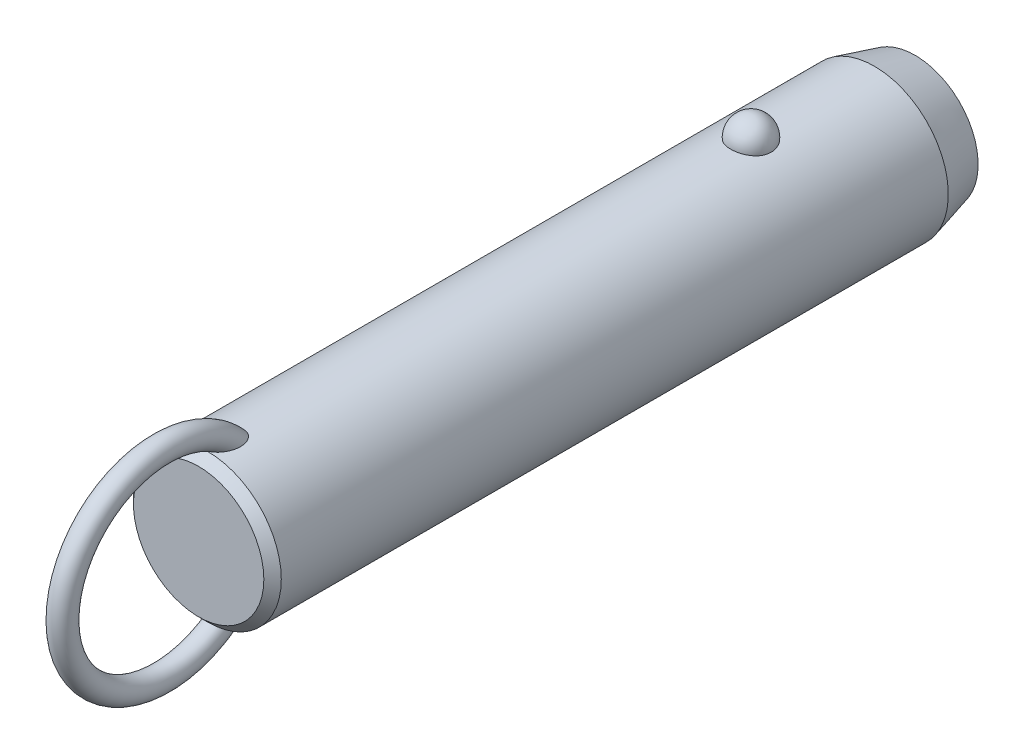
ISO-10303-21;
HEADER;
FILE_DESCRIPTION(('STEP AP214'),'2;1');
FILE_NAME('part.step','',(''),(''),'','','');
FILE_SCHEMA(('AUTOMOTIVE_DESIGN { 1 0 10303 214 1 1 1 1 }'));
ENDSEC;
DATA;
#1=APPLICATION_CONTEXT('core data for automotive mechanical design processes');
#2=APPLICATION_PROTOCOL_DEFINITION('international standard','automotive_design',2000,#1);
#3=PRODUCT_CONTEXT('',#1,'mechanical');
#4=PRODUCT('Part','Part','',(#3));
#5=PRODUCT_RELATED_PRODUCT_CATEGORY('part','',(#4));
#6=PRODUCT_DEFINITION_FORMATION('','',#4);
#7=PRODUCT_DEFINITION_CONTEXT('part definition',#1,'design');
#8=PRODUCT_DEFINITION('design','',#6,#7);
#9=PRODUCT_DEFINITION_SHAPE('','',#8);
#10=(LENGTH_UNIT() NAMED_UNIT(*) SI_UNIT(.MILLI.,.METRE.));
#11=(NAMED_UNIT(*) PLANE_ANGLE_UNIT() SI_UNIT($,.RADIAN.));
#12=(NAMED_UNIT(*) SI_UNIT($,.STERADIAN.) SOLID_ANGLE_UNIT());
#13=UNCERTAINTY_MEASURE_WITH_UNIT(LENGTH_MEASURE(1.E-05),#10,'distance_accuracy_value','');
#14=(GEOMETRIC_REPRESENTATION_CONTEXT(3) GLOBAL_UNCERTAINTY_ASSIGNED_CONTEXT((#13)) GLOBAL_UNIT_ASSIGNED_CONTEXT((#10,
#11,#12)) REPRESENTATION_CONTEXT('',''));
#15=CARTESIAN_POINT('',(0.,0.,0.));
#16=DIRECTION('',(0.,0.,1.));
#17=DIRECTION('',(1.,0.,0.));
#18=AXIS2_PLACEMENT_3D('',#15,#16,#17);
#19=CARTESIAN_POINT('',(0.,0.,78.7));
#20=DIRECTION('',(0.,0.,-1.));
#21=DIRECTION('',(-1.,0.,0.));
#22=AXIS2_PLACEMENT_3D('',#19,#20,#21);
#23=CYLINDRICAL_SURFACE('',#22,12.7);
#24=CARTESIAN_POINT('',(3.46661256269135,12.2177165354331,-3.5));
#25=CARTESIAN_POINT('',(3.4666090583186,12.2177194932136,-3.30432790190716));
#26=CARTESIAN_POINT('',(3.45063567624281,12.2222841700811,-3.10861112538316));
#27=CARTESIAN_POINT('',(3.38712451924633,12.2400345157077,-2.72271899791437));
#28=CARTESIAN_POINT('',(3.33957415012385,12.2532236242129,-2.53254588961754));
#29=CARTESIAN_POINT('',(3.2141234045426,12.286724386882,-2.16324948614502));
#30=CARTESIAN_POINT('',(3.13623639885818,12.3070329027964,-1.98412136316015));
#31=CARTESIAN_POINT('',(2.95205930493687,12.3525018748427,-1.64180592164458));
#32=CARTESIAN_POINT('',(2.84577003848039,12.3776621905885,-1.47861814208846));
#33=CARTESIAN_POINT('',(2.60688050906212,12.4301712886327,-1.17190583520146));
#34=CARTESIAN_POINT('',(2.47415697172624,12.4575299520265,-1.02847897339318));
#35=CARTESIAN_POINT('',(2.18615174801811,12.5112810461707,-0.766177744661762));
#36=CARTESIAN_POINT('',(2.03087002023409,12.5376734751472,-0.64730342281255));
#37=CARTESIAN_POINT('',(1.70237334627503,12.5864761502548,-0.437732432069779));
#38=CARTESIAN_POINT('',(1.52920948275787,12.6088972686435,-0.346958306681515));
#39=CARTESIAN_POINT('',(1.16944170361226,12.6473352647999,-0.195750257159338));
#40=CARTESIAN_POINT('',(0.982839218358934,12.663352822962,-0.135313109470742));
#41=CARTESIAN_POINT('',(0.604961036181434,12.6869706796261,-0.0473241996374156));
#42=CARTESIAN_POINT('',(0.41382314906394,12.6947125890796,-0.0192185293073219));
#43=CARTESIAN_POINT('',(0.0293827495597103,12.7014203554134,0.0051725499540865));
#44=CARTESIAN_POINT('',(-0.163919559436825,12.7003870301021,0.00146092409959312));
#45=CARTESIAN_POINT('',(-0.544374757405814,12.689735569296,-0.0373939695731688));
#46=CARTESIAN_POINT('',(-0.731575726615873,12.6802364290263,-0.0721015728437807));
#47=CARTESIAN_POINT('',(-1.09733277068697,12.6538333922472,-0.171364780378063));
#48=CARTESIAN_POINT('',(-1.27588869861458,12.6369293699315,-0.235920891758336));
#49=CARTESIAN_POINT('',(-1.6204698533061,12.5973946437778,-0.393548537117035));
#50=CARTESIAN_POINT('',(-1.78641865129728,12.5747321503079,-0.486778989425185));
#51=CARTESIAN_POINT('',(-2.10030671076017,12.5261316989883,-0.699110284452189));
#52=CARTESIAN_POINT('',(-2.24824419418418,12.5001934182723,-0.818213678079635));
#53=CARTESIAN_POINT('',(-2.52491489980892,12.4472906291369,-1.08157124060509));
#54=CARTESIAN_POINT('',(-2.65324222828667,12.4203160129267,-1.22624992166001));
#55=CARTESIAN_POINT('',(-2.88410007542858,12.3687509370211,-1.53528325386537));
#56=CARTESIAN_POINT('',(-2.98662883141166,12.3441606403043,-1.69963924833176));
#57=CARTESIAN_POINT('',(-3.16432417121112,12.2998199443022,-2.04548497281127));
#58=CARTESIAN_POINT('',(-3.23917525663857,12.2801261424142,-2.22714424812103));
#59=CARTESIAN_POINT('',(-3.35800573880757,12.248167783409,-2.6009138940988));
#60=CARTESIAN_POINT('',(-3.4019860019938,12.2359030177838,-2.79302397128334));
#61=CARTESIAN_POINT('',(-3.45784812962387,12.2202347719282,-3.18140279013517));
#62=CARTESIAN_POINT('',(-3.46986123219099,12.2167950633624,-3.37765118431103));
#63=CARTESIAN_POINT('',(-3.46186273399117,12.2190638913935,-3.76943689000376));
#64=CARTESIAN_POINT('',(-3.44185196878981,12.2247721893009,-3.96497421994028));
#65=CARTESIAN_POINT('',(-3.37048652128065,12.2446381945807,-4.34881728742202));
#66=CARTESIAN_POINT('',(-3.31928253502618,12.2587552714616,-4.53715319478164));
#67=CARTESIAN_POINT('',(-3.18693461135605,12.2938237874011,-4.90231727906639));
#68=CARTESIAN_POINT('',(-3.1057895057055,12.3147754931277,-5.07914500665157));
#69=CARTESIAN_POINT('',(-2.91506431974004,12.3613125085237,-5.41732059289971));
#70=CARTESIAN_POINT('',(-2.80533587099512,12.3869217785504,-5.57858147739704));
#71=CARTESIAN_POINT('',(-2.560414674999,12.4398525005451,-5.88013283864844));
#72=CARTESIAN_POINT('',(-2.42522099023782,12.4671740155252,-6.02042254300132));
#73=CARTESIAN_POINT('',(-2.1323357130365,12.5205965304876,-6.27662798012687));
#74=CARTESIAN_POINT('',(-1.97456596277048,12.5466928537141,-6.3924554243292));
#75=CARTESIAN_POINT('',(-1.64115839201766,12.5946384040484,-6.59583547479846));
#76=CARTESIAN_POINT('',(-1.46552179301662,12.6164879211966,-6.68339001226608));
#77=CARTESIAN_POINT('',(-1.10356050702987,12.6532533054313,-6.82682153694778));
#78=CARTESIAN_POINT('',(-0.9173913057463,12.6682500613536,-6.8830698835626));
#79=CARTESIAN_POINT('',(-0.537836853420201,12.6900288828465,-6.96386887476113));
#80=CARTESIAN_POINT('',(-0.344452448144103,12.6968119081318,-6.9884232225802));
#81=CARTESIAN_POINT('',(0.0402577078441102,12.7013667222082,-7.00496469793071));
#82=CARTESIAN_POINT('',(0.231556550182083,12.6993008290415,-6.99753844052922));
#83=CARTESIAN_POINT('',(0.610105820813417,12.6867505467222,-6.9516636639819));
#84=CARTESIAN_POINT('',(0.797356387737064,12.6762664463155,-6.913216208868));
#85=CARTESIAN_POINT('',(1.16186657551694,12.6480587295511,-6.80658431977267));
#86=CARTESIAN_POINT('',(1.33915951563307,12.6303611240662,-6.73850666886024));
#87=CARTESIAN_POINT('',(1.67968518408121,12.5896027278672,-6.5745087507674));
#88=CARTESIAN_POINT('',(1.84291705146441,12.5665416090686,-6.47858678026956));
#89=CARTESIAN_POINT('',(2.15340192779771,12.5171072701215,-6.25982455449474));
#90=CARTESIAN_POINT('',(2.30037831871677,12.4906895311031,-6.13660186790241));
#91=CARTESIAN_POINT('',(2.5717412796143,12.4376567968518,-5.86739587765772));
#92=CARTESIAN_POINT('',(2.69612388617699,12.4110417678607,-5.72140858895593));
#93=CARTESIAN_POINT('',(2.92107785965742,12.360051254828,-5.40794137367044));
#94=CARTESIAN_POINT('',(3.02121329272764,12.3357209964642,-5.24014110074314));
#95=CARTESIAN_POINT('',(3.19236291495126,12.2925446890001,-4.88969865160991));
#96=CARTESIAN_POINT('',(3.26338839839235,12.2736965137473,-4.70706226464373));
#97=CARTESIAN_POINT('',(3.36788038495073,12.245404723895,-4.35469510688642));
#98=CARTESIAN_POINT('',(3.40484026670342,12.2351018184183,-4.18605935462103));
#99=CARTESIAN_POINT('',(3.45420764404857,12.2212564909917,-3.84496058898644));
#100=CARTESIAN_POINT('',(3.46661565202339,12.2177139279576,-3.67249765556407));
#101=CARTESIAN_POINT('',(3.46661256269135,12.2177165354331,-3.5));
#102=B_SPLINE_CURVE_WITH_KNOTS('',3,(#24,#25,#26,#27,#28,#29,#30,#31,#32,#33,#34,#35,#36,#37,
#38,#39,#40,#41,#42,#43,#44,#45,#46,#47,#48,#49,#50,#51,#52,#53,#54,#55,#56,#57,#58,#59,#60,#61,
#62,#63,#64,#65,#66,#67,#68,#69,#70,#71,#72,#73,#74,#75,#76,#77,#78,#79,#80,#81,#82,#83,#84,#85,
#86,#87,#88,#89,#90,#91,#92,#93,#94,#95,#96,#97,#98,#99,#100,#101),.UNSPECIFIED.,.T.,.F.,(4,2,2,
2,2,2,2,2,2,2,2,2,2,2,2,2,2,2,2,2,2,2,2,2,2,2,2,2,2,2,2,2,2,2,2,2,2,2,4),(0.,0.586396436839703,
1.17302689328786,1.7593990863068,2.34575431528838,2.93491084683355,3.52406845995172,
4.11158733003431,4.69904375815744,5.2762784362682,5.85345931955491,6.42265312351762,
6.99185659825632,7.56427334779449,8.136746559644,8.71981013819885,9.3029135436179,
9.89247258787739,10.4820150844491,11.0691335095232,11.6562366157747,12.2405256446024,
12.8248374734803,13.412244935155,13.9996740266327,14.5891883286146,15.1786623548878,
15.7609861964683,16.3432419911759,16.9148635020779,17.4864654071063,18.0560241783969,
18.6256177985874,19.2037609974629,19.7820055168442,20.3699810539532,20.957728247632,
21.4746855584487,21.9916320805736),.UNSPECIFIED.);
#103=CARTESIAN_POINT('',(3.46661256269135,12.2177165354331,-3.5));
#104=VERTEX_POINT('',#103);
#105=EDGE_CURVE('E41',#104,#104,#102,.T.);
#106=ORIENTED_EDGE('',*,*,#105,.T.);
#107=EDGE_LOOP('',(#106));
#108=FACE_BOUND('',#107,.T.);
#109=CARTESIAN_POINT('',(0.,0.,89.9));
#110=DIRECTION('',(0.,0.,1.));
#111=DIRECTION('',(1.,0.,0.));
#112=AXIS2_PLACEMENT_3D('',#109,#110,#111);
#113=CIRCLE('',#112,12.7);
#114=CARTESIAN_POINT('',(12.7,0.,89.9));
#115=VERTEX_POINT('',#114);
#116=EDGE_CURVE('E10',#115,#115,#113,.F.);
#117=ORIENTED_EDGE('',*,*,#116,.T.);
#118=EDGE_LOOP('',(#117));
#119=FACE_BOUND('',#118,.T.);
#120=CARTESIAN_POINT('',(-0.548122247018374,-12.6881662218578,83.6432187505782));
#121=CARTESIAN_POINT('',(-0.64886572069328,-12.6838128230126,83.677926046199));
#122=CARTESIAN_POINT('',(-0.746398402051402,-12.6783867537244,83.7220428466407));
#123=CARTESIAN_POINT('',(-0.93212506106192,-12.666091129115,83.8267647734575));
#124=CARTESIAN_POINT('',(-1.02030388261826,-12.6592192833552,83.887396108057));
#125=CARTESIAN_POINT('',(-1.18487740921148,-12.6448747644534,84.021847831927));
#126=CARTESIAN_POINT('',(-1.26134296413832,-12.637406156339,84.0955825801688));
#127=CARTESIAN_POINT('',(-1.4023120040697,-12.6225412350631,84.2536045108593));
#128=CARTESIAN_POINT('',(-1.46681470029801,-12.6151449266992,84.3378923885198));
#129=CARTESIAN_POINT('',(-1.60714786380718,-12.5981718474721,84.5496577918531));
#130=CARTESIAN_POINT('',(-1.67725126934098,-12.588900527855,84.680962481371));
#131=CARTESIAN_POINT('',(-1.79536591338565,-12.5725964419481,84.9532471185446));
#132=CARTESIAN_POINT('',(-1.84333535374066,-12.5655679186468,85.0942447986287));
#133=CARTESIAN_POINT('',(-1.93422576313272,-12.5519624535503,85.4376455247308));
#134=CARTESIAN_POINT('',(-1.96788773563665,-12.5466298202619,85.6425578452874));
#135=CARTESIAN_POINT('',(-1.9941399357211,-12.542463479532,85.9517600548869));
#136=CARTESIAN_POINT('',(-1.99883864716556,-12.5417153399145,86.0552987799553));
#137=CARTESIAN_POINT('',(-2.00078003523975,-12.5414074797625,86.2624512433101));
#138=CARTESIAN_POINT('',(-1.99802449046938,-12.5418474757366,86.3660649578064));
#139=CARTESIAN_POINT('',(-1.98336733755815,-12.5441750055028,86.6103207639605));
#140=CARTESIAN_POINT('',(-1.96851430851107,-12.5465291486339,86.750780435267));
#141=CARTESIAN_POINT('',(-1.92707089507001,-12.5529612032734,87.0299607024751));
#142=CARTESIAN_POINT('',(-1.900474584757,-12.5570399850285,87.1686803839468));
#143=CARTESIAN_POINT('',(-1.83619120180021,-12.5666008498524,87.4434113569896));
#144=CARTESIAN_POINT('',(-1.79850828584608,-12.57208240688,87.5794236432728));
#145=CARTESIAN_POINT('',(-1.71223796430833,-12.5841228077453,87.8478421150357));
#146=CARTESIAN_POINT('',(-1.6636567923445,-12.5906810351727,87.9802503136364));
#147=CARTESIAN_POINT('',(-1.57804503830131,-12.6016176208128,88.1854887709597));
#148=CARTESIAN_POINT('',(-1.54477252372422,-12.6057501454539,88.2599149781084));
#149=CARTESIAN_POINT('',(-1.47424480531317,-12.6141930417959,88.4068393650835));
#150=CARTESIAN_POINT('',(-1.43699041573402,-12.6185033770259,88.4793379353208));
#151=CARTESIAN_POINT('',(-1.35825795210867,-12.6272207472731,88.6218926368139));
#152=CARTESIAN_POINT('',(-1.31678520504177,-12.6316276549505,88.6919517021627));
#153=CARTESIAN_POINT('',(-1.22917793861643,-12.6404532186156,88.8290705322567));
#154=CARTESIAN_POINT('',(-1.18304514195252,-12.6448718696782,88.8961313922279));
#155=CARTESIAN_POINT('',(-1.07246411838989,-12.6547893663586,89.0438741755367));
#156=CARTESIAN_POINT('',(-1.00642239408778,-12.6602600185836,89.1233844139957));
#157=CARTESIAN_POINT('',(-0.864441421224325,-12.6707460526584,89.2731698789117));
#158=CARTESIAN_POINT('',(-0.788516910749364,-12.6757620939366,89.3434585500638));
#159=CARTESIAN_POINT('',(-0.652215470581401,-12.6833591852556,89.4486801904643));
#160=CARTESIAN_POINT('',(-0.59498203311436,-12.6861973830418,89.4876241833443));
#161=CARTESIAN_POINT('',(-0.475269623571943,-12.6912445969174,89.5564899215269));
#162=CARTESIAN_POINT('',(-0.412800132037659,-12.6934547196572,89.5864275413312));
#163=CARTESIAN_POINT('',(-0.295749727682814,-12.6966636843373,89.6297565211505));
#164=CARTESIAN_POINT('',(-0.241949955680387,-12.6978134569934,89.6452188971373));
#165=CARTESIAN_POINT('',(-0.132508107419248,-12.6994261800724,89.6668845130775));
#166=CARTESIAN_POINT('',(-0.0768679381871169,-12.6998898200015,89.6730970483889));
#167=CARTESIAN_POINT('',(0.0347696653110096,-12.7000752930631,89.6755838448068));
#168=CARTESIAN_POINT('',(0.0907676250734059,-12.6997954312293,89.6718353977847));
#169=CARTESIAN_POINT('',(0.201283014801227,-12.6985255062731,89.6547883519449));
#170=CARTESIAN_POINT('',(0.255799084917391,-12.6975348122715,89.6414812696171));
#171=CARTESIAN_POINT('',(0.376042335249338,-12.6946091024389,89.6020379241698));
#172=CARTESIAN_POINT('',(0.440950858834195,-12.6924943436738,89.5734492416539));
#173=CARTESIAN_POINT('',(0.565350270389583,-12.6875639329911,89.5063234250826));
#174=CARTESIAN_POINT('',(0.624828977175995,-12.6847467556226,89.4677646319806));
#175=CARTESIAN_POINT('',(0.774116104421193,-12.6767252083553,89.356949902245));
#176=CARTESIAN_POINT('',(0.859449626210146,-12.6711344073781,89.2787605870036));
#177=CARTESIAN_POINT('',(1.01789440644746,-12.6593922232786,89.110943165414));
#178=CARTESIAN_POINT('',(1.09096902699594,-12.653239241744,89.021282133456));
#179=CARTESIAN_POINT('',(1.22268793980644,-12.6411674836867,88.8402658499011));
#180=CARTESIAN_POINT('',(1.28193986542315,-12.6352572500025,88.749345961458));
#181=CARTESIAN_POINT('',(1.39259777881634,-12.6235401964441,88.5627929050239));
#182=CARTESIAN_POINT('',(1.44399707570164,-12.6177334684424,88.4671558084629));
#183=CARTESIAN_POINT('',(1.53972870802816,-12.6064093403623,88.2722738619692));
#184=CARTESIAN_POINT('',(1.58405262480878,-12.6008922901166,88.1730248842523));
#185=CARTESIAN_POINT('',(1.66600705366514,-12.5903187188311,87.9717727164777));
#186=CARTESIAN_POINT('',(1.70363651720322,-12.5852622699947,87.8697690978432));
#187=CARTESIAN_POINT('',(1.7754537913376,-12.5753406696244,87.6543580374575));
#188=CARTESIAN_POINT('',(1.80903453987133,-12.5705328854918,87.540745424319));
#189=CARTESIAN_POINT('',(1.86844163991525,-12.5618400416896,87.3114575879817));
#190=CARTESIAN_POINT('',(1.89426665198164,-12.5579551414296,87.1957820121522));
#191=CARTESIAN_POINT('',(1.93785464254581,-12.5513030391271,86.9630072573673));
#192=CARTESIAN_POINT('',(1.95562640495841,-12.5485346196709,86.8459097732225));
#193=CARTESIAN_POINT('',(1.98264463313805,-12.5442934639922,86.6107473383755));
#194=CARTESIAN_POINT('',(1.99189298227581,-12.5428204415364,86.4926826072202));
#195=CARTESIAN_POINT('',(2.00416068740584,-12.540871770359,86.1806225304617));
#196=CARTESIAN_POINT('',(1.99944433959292,-12.541631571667,85.986229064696));
#197=CARTESIAN_POINT('',(1.96113755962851,-12.5476846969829,85.6003095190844));
#198=CARTESIAN_POINT('',(1.92758341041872,-12.5529723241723,85.4087801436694));
#199=CARTESIAN_POINT('',(1.83934342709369,-12.5661532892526,85.0822728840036));
#200=CARTESIAN_POINT('',(1.79215440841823,-12.5730485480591,84.9452499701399));
#201=CARTESIAN_POINT('',(1.67676242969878,-12.588958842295,84.6804459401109));
#202=CARTESIAN_POINT('',(1.60859050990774,-12.597970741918,84.5526515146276));
#203=CARTESIAN_POINT('',(1.46583832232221,-12.6152829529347,84.3358006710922));
#204=CARTESIAN_POINT('',(1.39525727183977,-12.6233659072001,84.2441050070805));
#205=CARTESIAN_POINT('',(1.23992594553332,-12.6395676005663,84.0734854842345));
#206=CARTESIAN_POINT('',(1.15517932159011,-12.6476863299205,83.9945583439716));
#207=CARTESIAN_POINT('',(0.971995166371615,-12.6630846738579,83.8526438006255));
#208=CARTESIAN_POINT('',(0.873456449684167,-12.6703572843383,83.7897849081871));
#209=CARTESIAN_POINT('',(0.665847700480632,-12.6829569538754,83.6844870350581));
#210=CARTESIAN_POINT('',(0.556784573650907,-12.688285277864,83.6420347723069));
#211=CARTESIAN_POINT('',(0.347338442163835,-12.6956226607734,83.5844434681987));
#212=CARTESIAN_POINT('',(0.247759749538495,-12.6979816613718,83.5663996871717));
#213=CARTESIAN_POINT('',(0.0470218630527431,-12.7003077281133,83.5486007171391));
#214=CARTESIAN_POINT('',(-0.0541350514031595,-12.7002779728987,83.5488212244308));
#215=CARTESIAN_POINT('',(-0.221414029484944,-12.6982482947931,83.5643639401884));
#216=CARTESIAN_POINT('',(-0.288055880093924,-12.6969033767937,83.5746662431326));
#217=CARTESIAN_POINT('',(-0.419599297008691,-12.6932369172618,83.6031348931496));
#218=CARTESIAN_POINT('',(-0.484501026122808,-12.6909154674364,83.6213005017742));
#219=CARTESIAN_POINT('',(-0.548122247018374,-12.6881662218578,83.6432187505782));
#220=B_SPLINE_CURVE_WITH_KNOTS('',3,(#120,#121,#122,#123,#124,#125,#126,#127,#128,#129,#130,
#131,#132,#133,#134,#135,#136,#137,#138,#139,#140,#141,#142,#143,#144,#145,#146,#147,#148,#149,
#150,#151,#152,#153,#154,#155,#156,#157,#158,#159,#160,#161,#162,#163,#164,#165,#166,#167,#168,
#169,#170,#171,#172,#173,#174,#175,#176,#177,#178,#179,#180,#181,#182,#183,#184,#185,#186,#187,
#188,#189,#190,#191,#192,#193,#194,#195,#196,#197,#198,#199,#200,#201,#202,#203,#204,#205,#206,
#207,#208,#209,#210,#211,#212,#213,#214,#215,#216,#217,#218,#219),.UNSPECIFIED.,.T.,.F.,(4,2,2,
2,2,2,2,2,2,2,2,2,2,2,2,2,2,2,2,2,2,2,2,2,2,2,2,2,2,2,2,2,2,2,2,2,2,2,2,2,2,2,2,2,2,2,2,2,2,4),
(0.,0.319642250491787,0.639794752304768,0.957927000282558,1.27608021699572,1.72100165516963,
2.16675988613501,2.78630021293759,3.09705782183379,3.40774128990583,3.83096358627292,
4.25439969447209,4.67767724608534,5.1007133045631,5.34550297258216,5.59024267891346,
5.83467707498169,6.07902143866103,6.38891080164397,6.69834321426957,6.90560910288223,
7.11250749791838,7.279773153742,7.44687060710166,7.6143493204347,7.78197685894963,
7.99365544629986,8.20579780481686,8.55147335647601,8.89816429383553,9.22375138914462,
9.54961437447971,9.87586224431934,10.202161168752,10.5575872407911,10.9130746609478,
11.2681734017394,11.6231936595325,12.2046601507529,12.7853961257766,13.219164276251,
13.6522938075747,13.9989174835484,14.3454519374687,14.6946768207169,15.0436740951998,
15.3457513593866,15.6474266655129,15.8493051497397,16.0511646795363),.UNSPECIFIED.);
#221=CARTESIAN_POINT('',(-0.548122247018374,-12.6881662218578,83.6432187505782));
#222=VERTEX_POINT('',#221);
#223=EDGE_CURVE('E60',#222,#222,#220,.T.);
#224=ORIENTED_EDGE('',*,*,#223,.T.);
#225=EDGE_LOOP('',(#224));
#226=FACE_BOUND('',#225,.T.);
#227=CARTESIAN_POINT('',(-0.548122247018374,12.6881662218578,83.6432187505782));
#228=CARTESIAN_POINT('',(-0.459436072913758,12.6919968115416,83.612673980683));
#229=CARTESIAN_POINT('',(-0.368189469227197,12.6949996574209,83.5893913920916));
#230=CARTESIAN_POINT('',(-0.183024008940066,12.6990186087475,83.5584062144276));
#231=CARTESIAN_POINT('',(-0.0891049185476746,12.7000345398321,83.5507049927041));
#232=CARTESIAN_POINT('',(0.0987147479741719,12.6999636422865,83.5512455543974));
#233=CARTESIAN_POINT('',(0.192615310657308,12.6988761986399,83.5594920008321));
#234=CARTESIAN_POINT('',(0.377658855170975,12.6947211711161,83.5915515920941));
#235=CARTESIAN_POINT('',(0.468801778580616,12.6916535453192,83.6153650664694));
#236=CARTESIAN_POINT('',(0.645809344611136,12.6838788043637,83.6774565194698));
#237=CARTESIAN_POINT('',(0.731679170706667,12.6791733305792,83.715720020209));
#238=CARTESIAN_POINT('',(0.896315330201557,12.6686004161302,83.8051204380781));
#239=CARTESIAN_POINT('',(0.975080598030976,12.6627328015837,83.8562592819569));
#240=CARTESIAN_POINT('',(1.12963655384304,12.6499161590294,83.9736782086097));
#241=CARTESIAN_POINT('',(1.20478673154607,12.6429194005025,84.0407929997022));
#242=CARTESIAN_POINT('',(1.34448241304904,12.6288282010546,84.1852250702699));
#243=CARTESIAN_POINT('',(1.40902173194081,12.621733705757,84.2625482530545));
#244=CARTESIAN_POINT('',(1.55208211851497,12.6050877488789,84.4592475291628));
#245=CARTESIAN_POINT('',(1.62510490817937,12.5957546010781,84.5826540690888));
#246=CARTESIAN_POINT('',(1.7501904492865,12.5789823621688,84.8397690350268));
#247=CARTESIAN_POINT('',(1.80221377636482,12.5715468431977,84.973496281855));
#248=CARTESIAN_POINT('',(1.90309965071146,12.5567434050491,85.2983516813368));
#249=CARTESIAN_POINT('',(1.94342317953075,12.5504515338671,85.4921611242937));
#250=CARTESIAN_POINT('',(1.99332997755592,12.5426147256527,85.8837881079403));
#251=CARTESIAN_POINT('',(2.00285305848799,12.5410790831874,86.0816127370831));
#252=CARTESIAN_POINT('',(1.99678999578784,12.5420407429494,86.4166427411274));
#253=CARTESIAN_POINT('',(1.98794117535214,12.5434564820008,86.5540428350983));
#254=CARTESIAN_POINT('',(1.95865119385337,12.5480641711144,86.8276394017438));
#255=CARTESIAN_POINT('',(1.9382043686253,12.5512569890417,86.9638352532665));
#256=CARTESIAN_POINT('',(1.88647896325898,12.5591352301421,87.2342493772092));
#257=CARTESIAN_POINT('',(1.85518800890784,12.5638223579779,87.3684652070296));
#258=CARTESIAN_POINT('',(1.78217886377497,12.5743868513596,87.6339362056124));
#259=CARTESIAN_POINT('',(1.74046509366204,12.5802637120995,87.7651926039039));
#260=CARTESIAN_POINT('',(1.66024095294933,12.5910571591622,87.9860855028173));
#261=CARTESIAN_POINT('',(1.62434772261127,12.5957535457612,88.0766904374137));
#262=CARTESIAN_POINT('',(1.5470900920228,12.6054762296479,88.2555125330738));
#263=CARTESIAN_POINT('',(1.50572681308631,12.6105024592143,88.3437301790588));
#264=CARTESIAN_POINT('',(1.41728020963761,12.620748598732,88.5169321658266));
#265=CARTESIAN_POINT('',(1.37021377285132,12.625967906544,88.6019251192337));
#266=CARTESIAN_POINT('',(1.2696962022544,12.6364721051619,88.7680072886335));
#267=CARTESIAN_POINT('',(1.21624929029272,12.6417569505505,88.8490990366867));
#268=CARTESIAN_POINT('',(1.10304413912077,12.6521331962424,89.0047027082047));
#269=CARTESIAN_POINT('',(1.04340936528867,12.657226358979,89.0793033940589));
#270=CARTESIAN_POINT('',(0.915919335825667,12.6670906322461,89.221324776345));
#271=CARTESIAN_POINT('',(0.848064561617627,12.6718617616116,89.2887458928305));
#272=CARTESIAN_POINT('',(0.717035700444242,12.67987711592,89.4006247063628));
#273=CARTESIAN_POINT('',(0.655526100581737,12.6832377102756,89.4469970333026));
#274=CARTESIAN_POINT('',(0.525985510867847,12.6892676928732,89.5296195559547));
#275=CARTESIAN_POINT('',(0.457969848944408,12.6919386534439,89.5658927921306));
#276=CARTESIAN_POINT('',(0.334859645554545,12.695691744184,89.6166572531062));
#277=CARTESIAN_POINT('',(0.281116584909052,12.6970073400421,89.6343733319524));
#278=CARTESIAN_POINT('',(0.17142581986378,12.6989609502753,89.6606429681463));
#279=CARTESIAN_POINT('',(0.11548082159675,12.699599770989,89.6692074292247));
#280=CARTESIAN_POINT('',(0.00272618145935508,12.7001251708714,89.6762531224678));
#281=CARTESIAN_POINT('',(-0.0540859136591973,12.7000089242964,89.6746964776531));
#282=CARTESIAN_POINT('',(-0.166544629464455,12.6990328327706,89.6616005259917));
#283=CARTESIAN_POINT('',(-0.222190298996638,12.6981724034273,89.6500533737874));
#284=CARTESIAN_POINT('',(-0.342018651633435,12.695562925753,89.6149128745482));
#285=CARTESIAN_POINT('',(-0.405606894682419,12.6936676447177,89.5893322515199));
#286=CARTESIAN_POINT('',(-0.527815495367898,12.6891754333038,89.5283111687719));
#287=CARTESIAN_POINT('',(-0.586425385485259,12.6865770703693,89.4928505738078));
#288=CARTESIAN_POINT('',(-0.731842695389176,12.6792129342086,89.3914960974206));
#289=CARTESIAN_POINT('',(-0.814709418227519,12.6740767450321,89.3200395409));
#290=CARTESIAN_POINT('',(-0.969101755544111,12.6632083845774,89.1658900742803));
#291=CARTESIAN_POINT('',(-1.04059564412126,12.6574746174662,89.0831668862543));
#292=CARTESIAN_POINT('',(-1.16981116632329,12.6461638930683,88.9158096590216));
#293=CARTESIAN_POINT('',(-1.22811369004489,12.6405994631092,88.8316166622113));
#294=CARTESIAN_POINT('',(-1.33743405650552,12.6295007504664,88.6585791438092));
#295=CARTESIAN_POINT('',(-1.38844577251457,12.6239664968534,88.5697307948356));
#296=CARTESIAN_POINT('',(-1.48400702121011,12.6130898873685,88.388389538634));
#297=CARTESIAN_POINT('',(-1.52854232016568,12.6077479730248,88.2958891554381));
#298=CARTESIAN_POINT('',(-1.6115011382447,12.5974127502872,88.1081607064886));
#299=CARTESIAN_POINT('',(-1.64992317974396,12.5924195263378,88.0129319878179));
#300=CARTESIAN_POINT('',(-1.73468589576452,12.581070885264,87.7828936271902));
#301=CARTESIAN_POINT('',(-1.77831261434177,12.5749388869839,87.6470661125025));
#302=CARTESIAN_POINT('',(-1.85439734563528,12.5639437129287,87.3722128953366));
#303=CARTESIAN_POINT('',(-1.88684994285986,12.5590811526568,87.2331856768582));
#304=CARTESIAN_POINT('',(-1.94008483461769,12.550968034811,86.9530923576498));
#305=CARTESIAN_POINT('',(-1.96088706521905,12.5477147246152,86.8120301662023));
#306=CARTESIAN_POINT('',(-1.99000539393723,12.5431291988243,86.5286689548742));
#307=CARTESIAN_POINT('',(-1.99832911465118,12.5417958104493,86.3863707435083));
#308=CARTESIAN_POINT('',(-2.00166624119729,12.5412674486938,86.0576271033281));
#309=CARTESIAN_POINT('',(-1.99178843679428,12.5428579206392,85.871088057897));
#310=CARTESIAN_POINT('',(-1.9445518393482,12.5502731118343,85.5016240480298));
#311=CARTESIAN_POINT('',(-1.90724032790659,12.5560905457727,85.3186934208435));
#312=CARTESIAN_POINT('',(-1.81330718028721,12.5699462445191,85.0048488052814));
#313=CARTESIAN_POINT('',(-1.76338820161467,12.5771273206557,84.8719105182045));
#314=CARTESIAN_POINT('',(-1.64305018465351,12.593414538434,84.6156813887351));
#315=CARTESIAN_POINT('',(-1.57265346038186,12.6025185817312,84.492380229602));
#316=CARTESIAN_POINT('',(-1.42634956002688,12.6198178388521,84.2835648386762));
#317=CARTESIAN_POINT('',(-1.35423772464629,12.6278405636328,84.1953846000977));
#318=CARTESIAN_POINT('',(-1.19645664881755,12.6437632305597,84.032107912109));
#319=CARTESIAN_POINT('',(-1.11080536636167,12.6516633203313,83.9569944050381));
#320=CARTESIAN_POINT('',(-0.947219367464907,12.6648319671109,83.8378114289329));
#321=CARTESIAN_POINT('',(-0.871624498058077,12.670300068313,83.7905414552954));
#322=CARTESIAN_POINT('',(-0.714161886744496,12.6801492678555,83.7077413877));
#323=CARTESIAN_POINT('',(-0.632295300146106,12.684530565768,83.6722091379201));
#324=CARTESIAN_POINT('',(-0.548122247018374,12.6881662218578,83.6432187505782));
#325=B_SPLINE_CURVE_WITH_KNOTS('',3,(#227,#228,#229,#230,#231,#232,#233,#234,#235,#236,#237,
#238,#239,#240,#241,#242,#243,#244,#245,#246,#247,#248,#249,#250,#251,#252,#253,#254,#255,#256,
#257,#258,#259,#260,#261,#262,#263,#264,#265,#266,#267,#268,#269,#270,#271,#272,#273,#274,#275,
#276,#277,#278,#279,#280,#281,#282,#283,#284,#285,#286,#287,#288,#289,#290,#291,#292,#293,#294,
#295,#296,#297,#298,#299,#300,#301,#302,#303,#304,#305,#306,#307,#308,#309,#310,#311,#312,#313,
#314,#315,#316,#317,#318,#319,#320,#321,#322,#323,#324),.UNSPECIFIED.,.T.,.F.,(4,2,2,2,2,2,2,2,
2,2,2,2,2,2,2,2,2,2,2,2,2,2,2,2,2,2,2,2,2,2,2,2,2,2,2,2,2,2,2,2,2,2,2,2,2,2,2,2,4),(0.,
0.281328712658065,0.562682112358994,0.844117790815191,1.12555942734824,1.40671982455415,
1.68792232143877,1.98972294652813,2.29169886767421,2.72039860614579,3.14989948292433,
3.74084916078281,4.33295293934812,4.74554109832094,5.15833092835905,5.57159335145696,
5.98468079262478,6.2772277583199,6.56971484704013,6.86135609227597,7.15280542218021,
7.43927407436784,7.72572595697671,7.9563586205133,8.18646071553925,8.35559393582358,
8.52452541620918,8.69408946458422,8.86378678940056,9.06834348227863,9.27332014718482,
9.60010414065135,9.92778432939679,10.2350252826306,10.5425229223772,10.8506864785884,
11.1589244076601,11.5867893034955,12.0148612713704,12.4421984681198,12.8692745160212,
13.4279365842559,13.9856380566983,14.4107062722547,14.8353130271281,15.1765567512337,
15.5173516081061,15.7844129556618,16.051425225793),.UNSPECIFIED.);
#326=CARTESIAN_POINT('',(-0.548122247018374,12.6881662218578,83.6432187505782));
#327=VERTEX_POINT('',#326);
#328=EDGE_CURVE('E68',#327,#327,#325,.T.);
#329=ORIENTED_EDGE('',*,*,#328,.T.);
#330=EDGE_LOOP('',(#329));
#331=FACE_BOUND('',#330,.T.);
#332=CARTESIAN_POINT('',(0.,0.,-24.6999999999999));
#333=DIRECTION('',(0.,0.,-1.));
#334=DIRECTION('',(-1.,0.,0.));
#335=AXIS2_PLACEMENT_3D('',#332,#333,#334);
#336=CIRCLE('',#335,12.7);
#337=CARTESIAN_POINT('',(-12.7,0.,-24.6999999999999));
#338=VERTEX_POINT('',#337);
#339=EDGE_CURVE('E57',#338,#338,#336,.F.);
#340=ORIENTED_EDGE('',*,*,#339,.T.);
#341=EDGE_LOOP('',(#340));
#342=FACE_BOUND('',#341,.T.);
#343=ADVANCED_FACE('F37',(#108,#119,#226,#331,#342),#23,.T.);
#344=CARTESIAN_POINT('',(0.,0.,-31.7));
#345=DIRECTION('',(0.,0.,-1.));
#346=DIRECTION('',(-1.,0.,0.));
#347=AXIS2_PLACEMENT_3D('',#344,#345,#346);
#348=PLANE('',#347);
#349=CARTESIAN_POINT('',(0.,0.,-31.7));
#350=DIRECTION('',(0.,0.,-1.));
#351=DIRECTION('',(-1.,0.,0.));
#352=AXIS2_PLACEMENT_3D('',#349,#350,#351);
#353=CIRCLE('',#352,10.8243556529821);
#354=CARTESIAN_POINT('',(-10.8243556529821,0.,-31.7));
#355=VERTEX_POINT('',#354);
#356=EDGE_CURVE('E67',#355,#355,#353,.T.);
#357=ORIENTED_EDGE('',*,*,#356,.T.);
#358=EDGE_LOOP('',(#357));
#359=FACE_BOUND('',#358,.T.);
#360=ADVANCED_FACE('F86',(#359),#348,.T.);
#361=CARTESIAN_POINT('',(0.,0.,-31.7));
#362=DIRECTION('',(0.,0.,1.));
#363=DIRECTION('',(1.,0.,0.));
#364=AXIS2_PLACEMENT_3D('',#361,#362,#363);
#365=CONICAL_SURFACE('',#364,10.8243556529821,0.261799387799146);
#366=ORIENTED_EDGE('',*,*,#339,.F.);
#367=EDGE_LOOP('',(#366));
#368=FACE_BOUND('',#367,.T.);
#369=ORIENTED_EDGE('',*,*,#356,.F.);
#370=EDGE_LOOP('',(#369));
#371=FACE_BOUND('',#370,.T.);
#372=ADVANCED_FACE('F84',(#368,#371),#365,.T.);
#373=CARTESIAN_POINT('',(0.,0.,91.4));
#374=DIRECTION('',(0.,0.,1.));
#375=DIRECTION('',(1.,0.,0.));
#376=AXIS2_PLACEMENT_3D('',#373,#374,#375);
#377=PLANE('',#376);
#378=CARTESIAN_POINT('',(0.,0.,91.4));
#379=DIRECTION('',(0.,0.,1.));
#380=DIRECTION('',(1.,0.,0.));
#381=AXIS2_PLACEMENT_3D('',#378,#379,#380);
#382=CIRCLE('',#381,11.2);
#383=CARTESIAN_POINT('',(11.2,0.,91.4));
#384=VERTEX_POINT('',#383);
#385=EDGE_CURVE('E50',#384,#384,#382,.T.);
#386=ORIENTED_EDGE('',*,*,#385,.T.);
#387=EDGE_LOOP('',(#386));
#388=FACE_BOUND('',#387,.T.);
#389=ADVANCED_FACE('F78',(#388),#377,.T.);
#390=CARTESIAN_POINT('',(0.,0.,97.75));
#391=DIRECTION('',(1.,0.,0.));
#392=DIRECTION('',(0.,0.,-1.));
#393=AXIS2_PLACEMENT_3D('',#390,#391,#392);
#394=TOROIDAL_SURFACE('',#393,17.05,2.);
#395=ORIENTED_EDGE('',*,*,#328,.F.);
#396=EDGE_LOOP('',(#395));
#397=FACE_BOUND('',#396,.T.);
#398=ORIENTED_EDGE('',*,*,#223,.F.);
#399=EDGE_LOOP('',(#398));
#400=FACE_BOUND('',#399,.T.);
#401=ADVANCED_FACE('F74',(#397,#400),#394,.T.);
#402=CARTESIAN_POINT('',(0.,0.,91.4));
#403=DIRECTION('',(0.,0.,-1.));
#404=DIRECTION('',(-1.,0.,0.));
#405=AXIS2_PLACEMENT_3D('',#402,#403,#404);
#406=CONICAL_SURFACE('',#405,11.2,0.785398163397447);
#407=ORIENTED_EDGE('',*,*,#116,.F.);
#408=EDGE_LOOP('',(#407));
#409=FACE_BOUND('',#408,.T.);
#410=ORIENTED_EDGE('',*,*,#385,.F.);
#411=EDGE_LOOP('',(#410));
#412=FACE_BOUND('',#411,.T.);
#413=ADVANCED_FACE('F39',(#409,#412),#406,.T.);
#414=CARTESIAN_POINT('',(0.,12.7,-3.5));
#415=DIRECTION('',(0.,1.,0.));
#416=DIRECTION('',(0.,0.,-1.));
#417=AXIS2_PLACEMENT_3D('',#414,#415,#416);
#418=SPHERICAL_SURFACE('',#417,3.5);
#419=ORIENTED_EDGE('',*,*,#105,.F.);
#420=EDGE_LOOP('',(#419));
#421=FACE_BOUND('',#420,.T.);
#422=ADVANCED_FACE('F80',(#421),#418,.T.);
#423=CLOSED_SHELL('',(#343,#360,#372,#389,#401,#413,#422));
#424=MANIFOLD_SOLID_BREP('B2',#423);
#425=ADVANCED_BREP_SHAPE_REPRESENTATION('',(#18,#424),#14);
#426=SHAPE_DEFINITION_REPRESENTATION(#9,#425);
ENDSEC;
END-ISO-10303-21;
